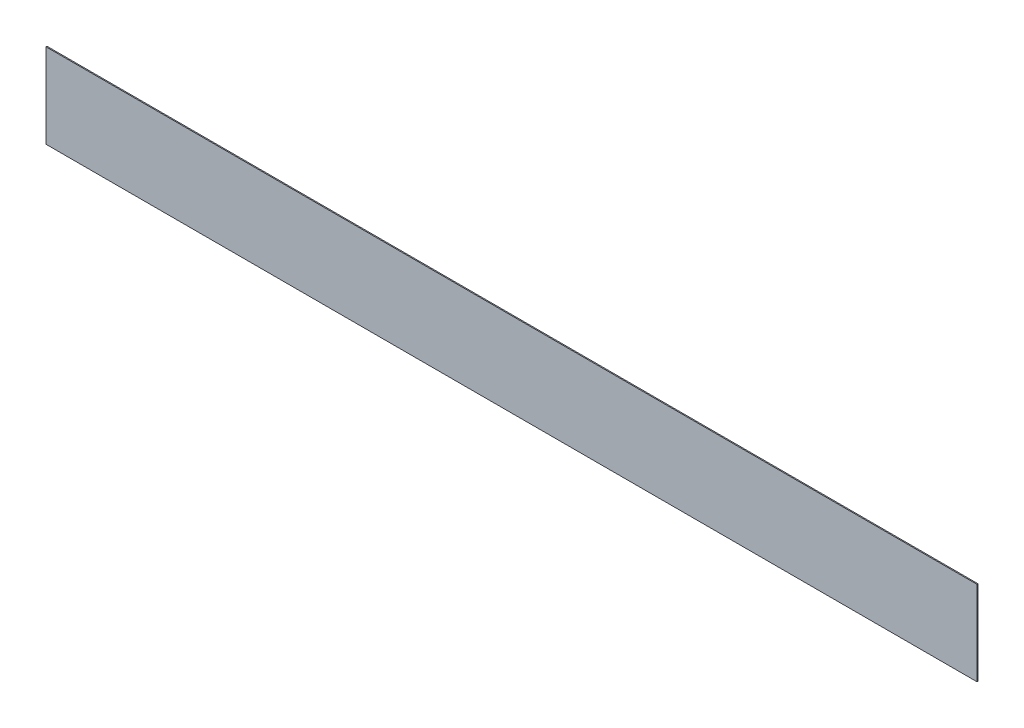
from build123d import *

# Parameters (mm, degrees)
ESQUISSE1_W        = 1820
ESQUISSE1_H        = 165
BOSS_EXTRU_1_DEPTH = 2


with BuildPart() as part:
    # Esquisse1 → Boss.-Extru.1 (new body)
    with BuildSketch(Plane.XY):
        with Locations((791.868931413, -43.647563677)):
            Rectangle(ESQUISSE1_W, ESQUISSE1_H)
    extrude(amount=BOSS_EXTRU_1_DEPTH)


solid = part.part
